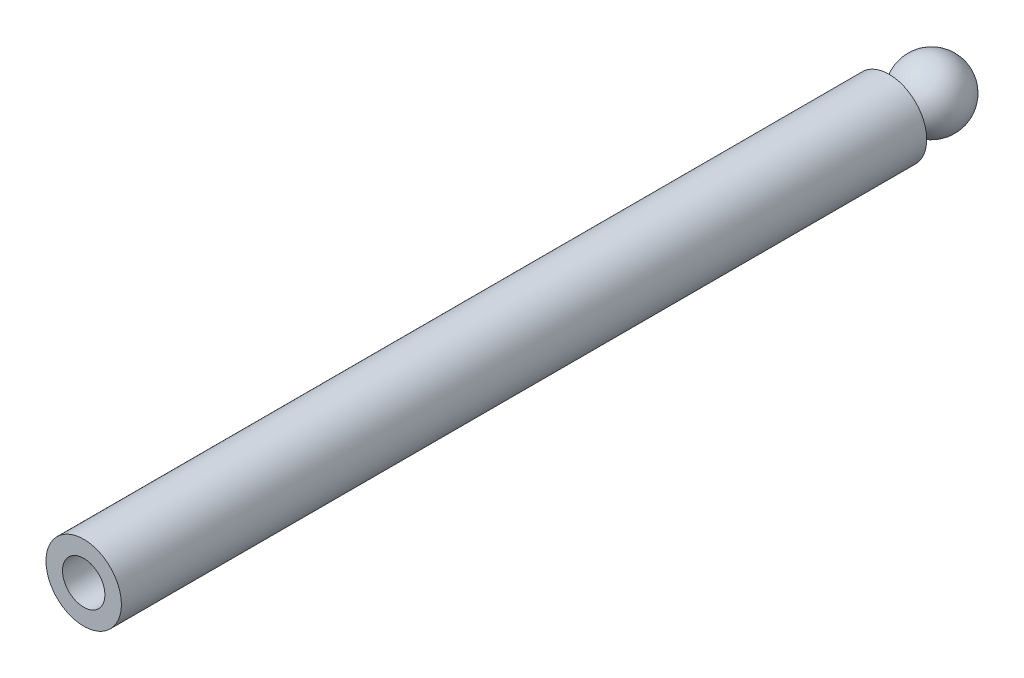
from build123d import *

# Parameters (mm, degrees)
SKETCH_2_R          = 10
EXTRUDE_1_DEPTH     = 45
SKETCH_3_R          = 40
EXTRUDE_2_DEPTH     = 855
SKETCH_4_R          = 22.5
CUT_EXTRUDE_3_DEPTH = 450


with BuildPart() as part:
    # Sketch 1 → Revolve 1 (revolve)
    with BuildSketch(Plane.XY):
        with BuildLine():
            Line((0, 35), (0, -35))
            ThreePointArc((0, -35), (35, 0), (0, 35))
        make_face()
    revolve(axis=Axis((0, 75.987150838, 0), (0, -1, 0)))

    # Sketch 2 → Extrude 1 (add)
    with BuildSketch(Plane.XY):
        with Locations(Location((0, 0, 0), (0, 0, 180))):
            Circle(SKETCH_2_R)
    extrude(amount=EXTRUDE_1_DEPTH)

    # Sketch 3 → Extrude 2 (add)
    with BuildSketch(Plane.XY.offset(45)):
        with Locations(Location((0, 0, 0), (0, 0, 180))):
            Circle(SKETCH_3_R)
    extrude(amount=EXTRUDE_2_DEPTH)

    # Sketch 4 → Cut-Extrude 3 (cut)
    with BuildSketch(Plane.XY.offset(900)):
        Circle(SKETCH_4_R)
    extrude(amount=-CUT_EXTRUDE_3_DEPTH, mode=Mode.SUBTRACT)


solid = part.part
